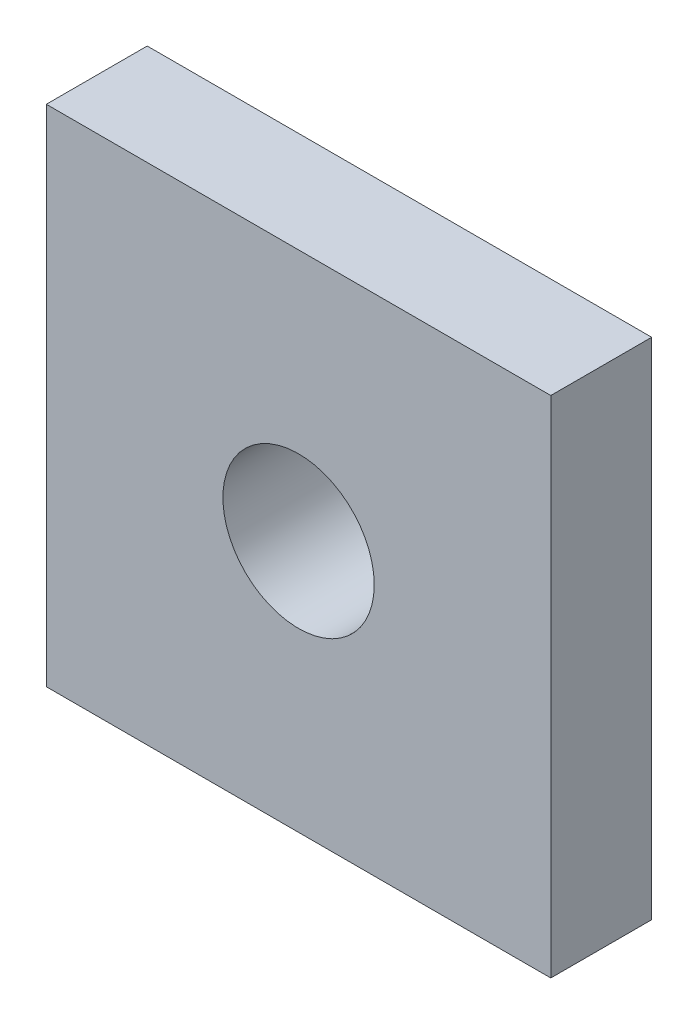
from build123d import *

# Parameters (mm, degrees)
SKETCH_1_W          = 100
SKETCH_1_H          = 100
EXTRUDE_1_DEPTH     = 20
SKETCH_2_R          = 30
EXTRUDE_2_DEPTH     = 40
SKETCH_3_R          = 15
CUT_EXTRUDE_1_DEPTH = 30


with BuildPart() as part:
    # Sketch 1 → Extrude 1 (new body)
    with BuildSketch(Plane.XY):
        Rectangle(SKETCH_1_W, SKETCH_1_H)
    extrude(amount=-EXTRUDE_1_DEPTH)

    # Sketch 2 → Extrude 2 (add)
    with BuildSketch(Plane.XY):
        Circle(SKETCH_2_R)
    extrude(amount=-EXTRUDE_2_DEPTH)

    # Sketch 3 → Cut-Extrude 1 (cut)
    with BuildSketch(Plane.XY):
        Circle(SKETCH_3_R)
    extrude(amount=-CUT_EXTRUDE_1_DEPTH, mode=Mode.SUBTRACT)


solid = part.part
